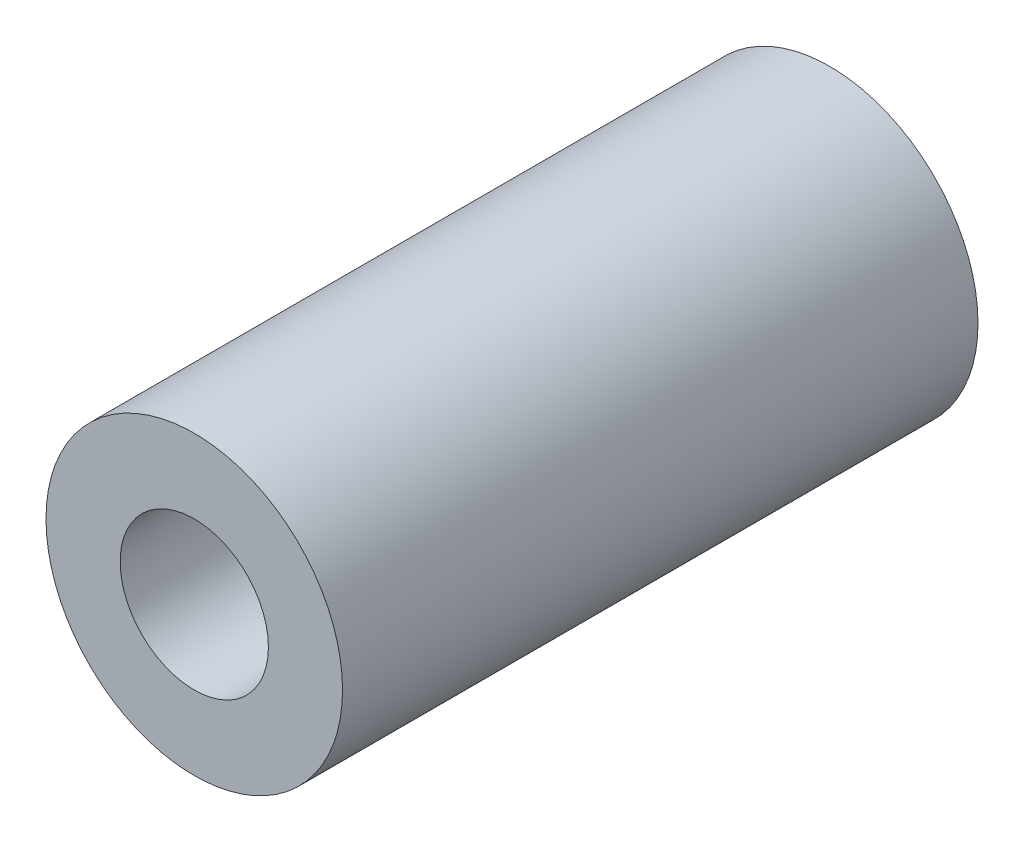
from build123d import *

# Parameters (mm, degrees)
ESQUISSE1_R      = 3.5
ESQUISSE1_R_2    = 1.75
EXTRUSION1_DEPTH = 15


with BuildPart() as part:
    # Esquisse1 → Extrusion1 (new body)
    with BuildSketch(Plane.XY):
        Circle(ESQUISSE1_R)
        Circle(ESQUISSE1_R_2, mode=Mode.SUBTRACT)
    extrude(amount=-EXTRUSION1_DEPTH)


solid = part.part
